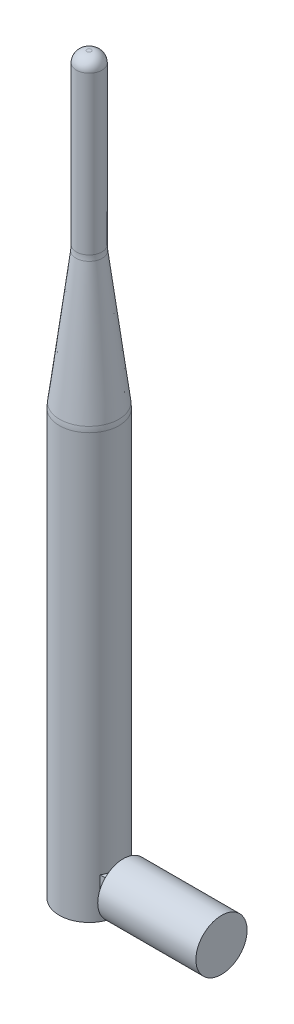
from build123d import *

# Parameters (mm, degrees)
SKETCH3_W           = 23
SKETCH3_H           = 6
SKETCH4_W           = 7
SKETCH4_H           = 7
BOSS_EXTRUDE2_DEPTH = 10


with BuildPart() as part:
    # Sketch2 → Antenna (revolve)
    with BuildSketch(Plane.XY, mode=Mode.PRIVATE) as antenna_sk:
        with BuildLine():
            Line((3, 169.5), (3, 132.622577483))
            ThreePointArc((3, 132.622577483), (3.019323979, 132.001203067), (3.077221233, 131.382230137))
            Line((3.077221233, 131.382230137), (6.922778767, 100.617769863))
            ThreePointArc((6.922778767, 100.617769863), (6.980676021, 99.998796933), (7, 99.377422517))
            Line((7, 99.377422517), (7, 0))
            Line((7, 0), (0, 0))
            Line((0, 0), (0, 172))
            Line((0, 172), (0.5, 172))
            ThreePointArc((0.5, 172), (2.267766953, 171.267766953), (3, 169.5))
        make_face()
    revolve(antenna_sk.sketch.rotate(Axis((0, 0, 0), (0, 1, 0)), 90), axis=Axis((0, 0, 0), (0, 1, 0)))



with BuildPart() as body_2:
    # Sketch3 → Revolve2 (revolve)
    with BuildSketch(Plane.XY, mode=Mode.PRIVATE) as revolve2_sk:
        with Locations((19.5, 3)):
            Rectangle(SKETCH3_W, SKETCH3_H)
    revolve(revolve2_sk.sketch.rotate(Axis((8, 6, 0), (1, 0, 0)), 270), axis=Axis((8, 6, 0), (1, 0, 0)))


with BuildPart() as part_1:
    add(part.part)

    add(body_2.part)  # Boss-Extrude2 merges body 2
    # Sketch4 → Boss-Extrude2 (add)
    with BuildSketch(Plane.ZY.offset(-8)):
        with Locations((0, 6)):
            Rectangle(SKETCH4_W, SKETCH4_H)
    extrude(amount=BOSS_EXTRUDE2_DEPTH)


solid = part_1.part
